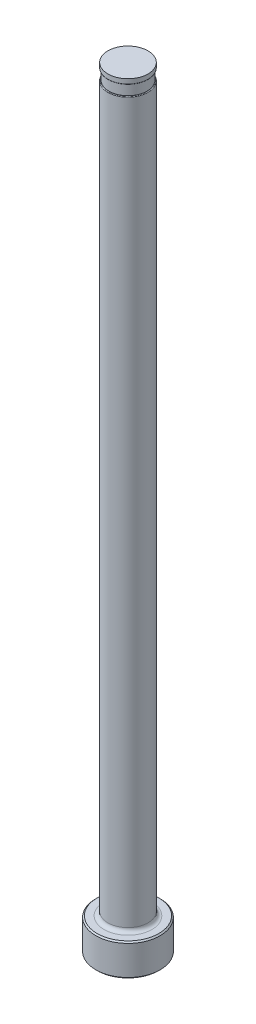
from build123d import *

# Parameters (mm, degrees)
CHAMFER1_SIZE     = 0.254
FILLET1_R         = 0.762
SKETCH2_W         = 0.2032
SKETCH2_H         = 2.032
D_SLOT_DEPTH      = 153.664354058
D_SLOT_DEPTH_BACK = 153.664354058
SKETCH5_W         = 0.00508
SKETCH5_H         = 1.016
FILLET2_R         = 0.127


with BuildPart() as part:
    # Sketch1 → Revolve1 (revolve)
    with BuildSketch(Plane.XY, mode=Mode.PRIVATE) as revolve1_sk:
        Polygon((0, 0), (-6.35, 0), (-6.35, 6.35), (-3.96875, 6.35), (-3.96875, 152.4), (0, 152.4), align=None)
    revolve(revolve1_sk.sketch.rotate(Axis((0, 259.958771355, 0), (0, -1, 0)), 270), axis=Axis((0, 259.958771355, 0), (0, -1, 0)))

    # Chamfer1
    chamfer1_edges = [part.edges().sort_by_distance(p)[0] for p in [
        (0, 6.35, -6.35),
        (0, 0, -6.35),
    ]]
    chamfer(chamfer1_edges, length=CHAMFER1_SIZE)

    # Fillet1
    fillet1_edges = [part.edges().sort_by_distance(p)[0] for p in [
        (0, 6.35, -3.96875),
    ]]
    fillet(fillet1_edges, radius=FILLET1_R)

    # Sketch2 → Vent Relief (revolve, cut)
    with BuildSketch(Plane.XY, mode=Mode.PRIVATE) as vent_relief_sk:
        with Locations((-3.86715, 150.368)):
            Rectangle(SKETCH2_W, SKETCH2_H)
    revolve(vent_relief_sk.sketch.rotate(Axis((0, 153.448281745, 0), (0, -1, 0)), 270), axis=Axis((0, 153.448281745, 0), (0, -1, 0)), mode=Mode.SUBTRACT)

    # Sketch3 → D-Slot (cut, two sides: drawn at the far end of the back side and taken through both)
    with BuildSketch(Plane.XY.offset(-D_SLOT_DEPTH_BACK)):
        with BuildLine():
            Line((-3.76555, 150.368), (-3.76555, 86.868))
            ThreePointArc((-3.76555, 86.868), (-3.816763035, 86.300038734), (-3.96875, 85.7504))
            Line((-3.96875, 85.7504), (-3.96875, 150.368))
            Line((-3.96875, 150.368), (-3.76555, 150.368))
        make_face()
    extrude(amount=D_SLOT_DEPTH + D_SLOT_DEPTH_BACK, mode=Mode.SUBTRACT)

    # Sketch5 → Vent Diameter (revolve, cut)
    with BuildSketch(Plane.XY, mode=Mode.PRIVATE) as vent_diameter_sk:
        with Locations((-3.96621, 151.892)):
            Rectangle(SKETCH5_W, SKETCH5_H)
    revolve(vent_diameter_sk.sketch.rotate(Axis((0, 152.687735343, 0), (0, -1, 0)), 90), axis=Axis((0, 152.687735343, 0), (0, -1, 0)), mode=Mode.SUBTRACT)

    # Fillet2
    fillet2_edges = [part.edges().sort_by_distance(p)[0] for p in [
        (3.219188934, 149.352, -2.321163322),
        (0, 151.384, 3.96367),
    ]]
    fillet(fillet2_edges, radius=FILLET2_R)


solid = part.part
